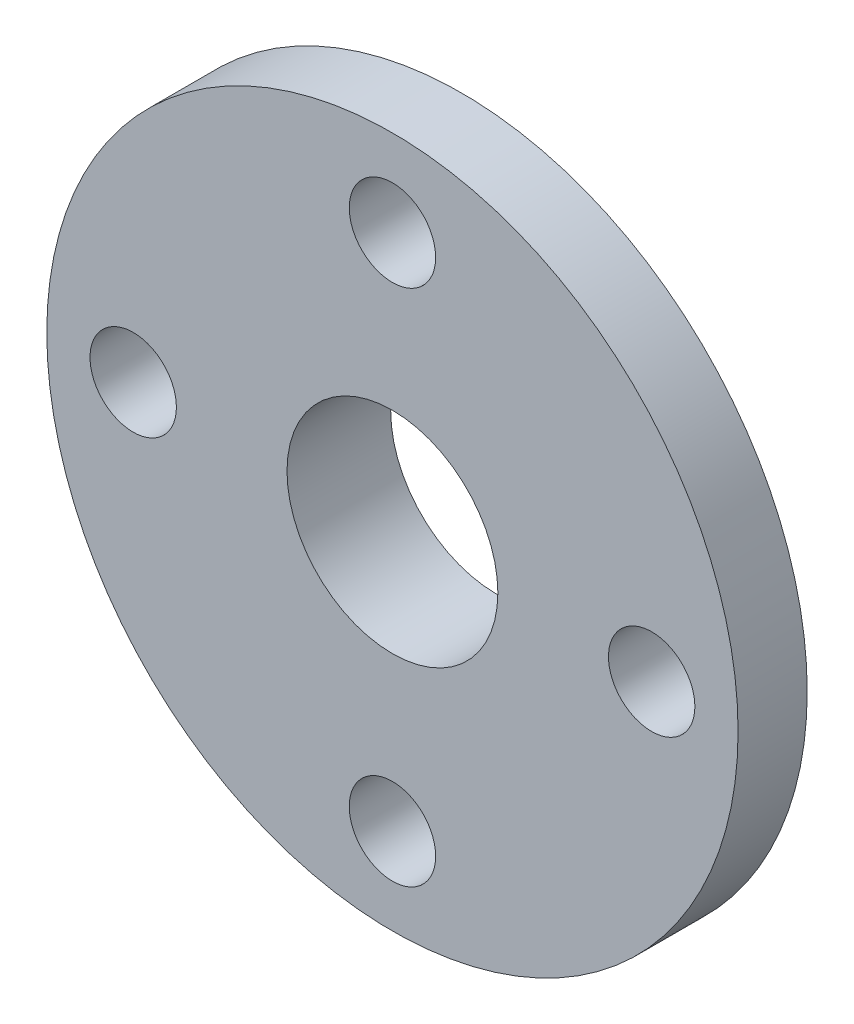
ISO-10303-21;
HEADER;
FILE_DESCRIPTION(('STEP AP214'),'2;1');
FILE_NAME('part.step','',(''),(''),'','','');
FILE_SCHEMA(('AUTOMOTIVE_DESIGN { 1 0 10303 214 1 1 1 1 }'));
ENDSEC;
DATA;
#1=APPLICATION_CONTEXT('core data for automotive mechanical design processes');
#2=APPLICATION_PROTOCOL_DEFINITION('international standard','automotive_design',2000,#1);
#3=PRODUCT_CONTEXT('',#1,'mechanical');
#4=PRODUCT('Part','Part','',(#3));
#5=PRODUCT_RELATED_PRODUCT_CATEGORY('part','',(#4));
#6=PRODUCT_DEFINITION_FORMATION('','',#4);
#7=PRODUCT_DEFINITION_CONTEXT('part definition',#1,'design');
#8=PRODUCT_DEFINITION('design','',#6,#7);
#9=PRODUCT_DEFINITION_SHAPE('','',#8);
#10=(LENGTH_UNIT() NAMED_UNIT(*) SI_UNIT(.MILLI.,.METRE.));
#11=(NAMED_UNIT(*) PLANE_ANGLE_UNIT() SI_UNIT($,.RADIAN.));
#12=(NAMED_UNIT(*) SI_UNIT($,.STERADIAN.) SOLID_ANGLE_UNIT());
#13=UNCERTAINTY_MEASURE_WITH_UNIT(LENGTH_MEASURE(1.E-05),#10,'distance_accuracy_value','');
#14=(GEOMETRIC_REPRESENTATION_CONTEXT(3) GLOBAL_UNCERTAINTY_ASSIGNED_CONTEXT((#13)) GLOBAL_UNIT_ASSIGNED_CONTEXT((#10,
#11,#12)) REPRESENTATION_CONTEXT('',''));
#15=CARTESIAN_POINT('',(0.,0.,0.));
#16=DIRECTION('',(0.,0.,1.));
#17=DIRECTION('',(1.,0.,0.));
#18=AXIS2_PLACEMENT_3D('',#15,#16,#17);
#19=CARTESIAN_POINT('',(0.,0.,2.));
#20=DIRECTION('',(0.,0.,1.));
#21=DIRECTION('',(1.,0.,0.));
#22=AXIS2_PLACEMENT_3D('',#19,#20,#21);
#23=PLANE('',#22);
#24=CARTESIAN_POINT('',(0.,0.,2.));
#25=DIRECTION('',(0.,0.,1.));
#26=DIRECTION('',(1.,0.,0.));
#27=AXIS2_PLACEMENT_3D('',#24,#25,#26);
#28=CIRCLE('',#27,3.05);
#29=CARTESIAN_POINT('',(3.05,0.,2.));
#30=VERTEX_POINT('',#29);
#31=EDGE_CURVE('E77',#30,#30,#28,.T.);
#32=ORIENTED_EDGE('',*,*,#31,.F.);
#33=EDGE_LOOP('',(#32));
#34=FACE_BOUND('',#33,.T.);
#35=CARTESIAN_POINT('',(7.5,0.,2.));
#36=DIRECTION('',(0.,0.,1.));
#37=DIRECTION('',(1.,0.,0.));
#38=AXIS2_PLACEMENT_3D('',#35,#36,#37);
#39=CIRCLE('',#38,1.25);
#40=CARTESIAN_POINT('',(8.75,0.,2.));
#41=VERTEX_POINT('',#40);
#42=EDGE_CURVE('E59',#41,#41,#39,.T.);
#43=ORIENTED_EDGE('',*,*,#42,.F.);
#44=EDGE_LOOP('',(#43));
#45=FACE_BOUND('',#44,.T.);
#46=CARTESIAN_POINT('',(-7.5,0.,2.));
#47=DIRECTION('',(0.,0.,1.));
#48=DIRECTION('',(1.,0.,0.));
#49=AXIS2_PLACEMENT_3D('',#46,#47,#48);
#50=CIRCLE('',#49,1.25);
#51=CARTESIAN_POINT('',(-6.25,0.,2.));
#52=VERTEX_POINT('',#51);
#53=EDGE_CURVE('E48',#52,#52,#50,.T.);
#54=ORIENTED_EDGE('',*,*,#53,.F.);
#55=EDGE_LOOP('',(#54));
#56=FACE_BOUND('',#55,.T.);
#57=CARTESIAN_POINT('',(0.,0.,2.));
#58=DIRECTION('',(0.,0.,1.));
#59=DIRECTION('',(1.,0.,0.));
#60=AXIS2_PLACEMENT_3D('',#57,#58,#59);
#61=CIRCLE('',#60,10.);
#62=CARTESIAN_POINT('',(10.,0.,2.));
#63=VERTEX_POINT('',#62);
#64=EDGE_CURVE('E39',#63,#63,#61,.T.);
#65=ORIENTED_EDGE('',*,*,#64,.T.);
#66=EDGE_LOOP('',(#65));
#67=FACE_BOUND('',#66,.T.);
#68=CARTESIAN_POINT('',(0.,7.5,2.));
#69=DIRECTION('',(0.,0.,1.));
#70=DIRECTION('',(1.,0.,0.));
#71=AXIS2_PLACEMENT_3D('',#68,#69,#70);
#72=CIRCLE('',#71,1.25);
#73=CARTESIAN_POINT('',(1.25,7.5,2.));
#74=VERTEX_POINT('',#73);
#75=EDGE_CURVE('E53',#74,#74,#72,.T.);
#76=ORIENTED_EDGE('',*,*,#75,.F.);
#77=EDGE_LOOP('',(#76));
#78=FACE_BOUND('',#77,.T.);
#79=CARTESIAN_POINT('',(0.,-7.5,2.));
#80=DIRECTION('',(0.,0.,1.));
#81=DIRECTION('',(1.,0.,0.));
#82=AXIS2_PLACEMENT_3D('',#79,#80,#81);
#83=CIRCLE('',#82,1.25);
#84=CARTESIAN_POINT('',(1.25,-7.5,2.));
#85=VERTEX_POINT('',#84);
#86=EDGE_CURVE('E65',#85,#85,#83,.T.);
#87=ORIENTED_EDGE('',*,*,#86,.F.);
#88=EDGE_LOOP('',(#87));
#89=FACE_BOUND('',#88,.T.);
#90=ADVANCED_FACE('F32',(#34,#45,#56,#67,#78,#89),#23,.T.);
#91=CARTESIAN_POINT('',(0.,0.,0.));
#92=DIRECTION('',(0.,0.,1.));
#93=DIRECTION('',(1.,0.,0.));
#94=AXIS2_PLACEMENT_3D('',#91,#92,#93);
#95=PLANE('',#94);
#96=CARTESIAN_POINT('',(0.,0.,0.));
#97=DIRECTION('',(0.,0.,1.));
#98=DIRECTION('',(1.,0.,0.));
#99=AXIS2_PLACEMENT_3D('',#96,#97,#98);
#100=CIRCLE('',#99,4.5);
#101=CARTESIAN_POINT('',(4.5,0.,0.));
#102=VERTEX_POINT('',#101);
#103=EDGE_CURVE('E10',#102,#102,#100,.F.);
#104=ORIENTED_EDGE('',*,*,#103,.F.);
#105=EDGE_LOOP('',(#104));
#106=FACE_BOUND('',#105,.T.);
#107=CARTESIAN_POINT('',(0.,0.,0.));
#108=DIRECTION('',(0.,0.,1.));
#109=DIRECTION('',(1.,0.,0.));
#110=AXIS2_PLACEMENT_3D('',#107,#108,#109);
#111=CIRCLE('',#110,10.);
#112=CARTESIAN_POINT('',(10.,0.,0.));
#113=VERTEX_POINT('',#112);
#114=EDGE_CURVE('E43',#113,#113,#111,.T.);
#115=ORIENTED_EDGE('',*,*,#114,.F.);
#116=EDGE_LOOP('',(#115));
#117=FACE_BOUND('',#116,.T.);
#118=CARTESIAN_POINT('',(-7.5,0.,0.));
#119=DIRECTION('',(0.,0.,1.));
#120=DIRECTION('',(1.,0.,0.));
#121=AXIS2_PLACEMENT_3D('',#118,#119,#120);
#122=CIRCLE('',#121,1.25);
#123=CARTESIAN_POINT('',(-6.25,0.,0.));
#124=VERTEX_POINT('',#123);
#125=EDGE_CURVE('E50',#124,#124,#122,.T.);
#126=ORIENTED_EDGE('',*,*,#125,.T.);
#127=EDGE_LOOP('',(#126));
#128=FACE_BOUND('',#127,.T.);
#129=CARTESIAN_POINT('',(0.,7.5,0.));
#130=DIRECTION('',(0.,0.,1.));
#131=DIRECTION('',(1.,0.,0.));
#132=AXIS2_PLACEMENT_3D('',#129,#130,#131);
#133=CIRCLE('',#132,1.25);
#134=CARTESIAN_POINT('',(1.25,7.5,0.));
#135=VERTEX_POINT('',#134);
#136=EDGE_CURVE('E56',#135,#135,#133,.T.);
#137=ORIENTED_EDGE('',*,*,#136,.T.);
#138=EDGE_LOOP('',(#137));
#139=FACE_BOUND('',#138,.T.);
#140=CARTESIAN_POINT('',(7.5,0.,0.));
#141=DIRECTION('',(0.,0.,1.));
#142=DIRECTION('',(1.,0.,0.));
#143=AXIS2_PLACEMENT_3D('',#140,#141,#142);
#144=CIRCLE('',#143,1.25);
#145=CARTESIAN_POINT('',(8.75,0.,0.));
#146=VERTEX_POINT('',#145);
#147=EDGE_CURVE('E62',#146,#146,#144,.T.);
#148=ORIENTED_EDGE('',*,*,#147,.T.);
#149=EDGE_LOOP('',(#148));
#150=FACE_BOUND('',#149,.T.);
#151=CARTESIAN_POINT('',(0.,-7.5,0.));
#152=DIRECTION('',(0.,0.,1.));
#153=DIRECTION('',(1.,0.,0.));
#154=AXIS2_PLACEMENT_3D('',#151,#152,#153);
#155=CIRCLE('',#154,1.25);
#156=CARTESIAN_POINT('',(1.25,-7.5,0.));
#157=VERTEX_POINT('',#156);
#158=EDGE_CURVE('E68',#157,#157,#155,.T.);
#159=ORIENTED_EDGE('',*,*,#158,.T.);
#160=EDGE_LOOP('',(#159));
#161=FACE_BOUND('',#160,.T.);
#162=ADVANCED_FACE('F94',(#106,#117,#128,#139,#150,#161),#95,.F.);
#163=CARTESIAN_POINT('',(0.,0.,2.));
#164=DIRECTION('',(0.,0.,-1.));
#165=DIRECTION('',(-1.,0.,0.));
#166=AXIS2_PLACEMENT_3D('',#163,#164,#165);
#167=CYLINDRICAL_SURFACE('',#166,10.);
#168=ORIENTED_EDGE('',*,*,#64,.F.);
#169=EDGE_LOOP('',(#168));
#170=FACE_BOUND('',#169,.T.);
#171=ORIENTED_EDGE('',*,*,#114,.T.);
#172=EDGE_LOOP('',(#171));
#173=FACE_BOUND('',#172,.T.);
#174=ADVANCED_FACE('F34',(#170,#173),#167,.T.);
#175=CARTESIAN_POINT('',(-7.5,0.,2.));
#176=DIRECTION('',(0.,0.,-1.));
#177=DIRECTION('',(-1.,0.,0.));
#178=AXIS2_PLACEMENT_3D('',#175,#176,#177);
#179=CYLINDRICAL_SURFACE('',#178,1.25);
#180=ORIENTED_EDGE('',*,*,#53,.T.);
#181=EDGE_LOOP('',(#180));
#182=FACE_BOUND('',#181,.T.);
#183=ORIENTED_EDGE('',*,*,#125,.F.);
#184=EDGE_LOOP('',(#183));
#185=FACE_BOUND('',#184,.T.);
#186=ADVANCED_FACE('F117',(#182,#185),#179,.F.);
#187=CARTESIAN_POINT('',(0.,7.5,2.));
#188=DIRECTION('',(0.,0.,-1.));
#189=DIRECTION('',(-1.,0.,0.));
#190=AXIS2_PLACEMENT_3D('',#187,#188,#189);
#191=CYLINDRICAL_SURFACE('',#190,1.25);
#192=ORIENTED_EDGE('',*,*,#75,.T.);
#193=EDGE_LOOP('',(#192));
#194=FACE_BOUND('',#193,.T.);
#195=ORIENTED_EDGE('',*,*,#136,.F.);
#196=EDGE_LOOP('',(#195));
#197=FACE_BOUND('',#196,.T.);
#198=ADVANCED_FACE('F123',(#194,#197),#191,.F.);
#199=CARTESIAN_POINT('',(7.5,0.,2.));
#200=DIRECTION('',(0.,0.,-1.));
#201=DIRECTION('',(-1.,0.,0.));
#202=AXIS2_PLACEMENT_3D('',#199,#200,#201);
#203=CYLINDRICAL_SURFACE('',#202,1.25);
#204=ORIENTED_EDGE('',*,*,#42,.T.);
#205=EDGE_LOOP('',(#204));
#206=FACE_BOUND('',#205,.T.);
#207=ORIENTED_EDGE('',*,*,#147,.F.);
#208=EDGE_LOOP('',(#207));
#209=FACE_BOUND('',#208,.T.);
#210=ADVANCED_FACE('F108',(#206,#209),#203,.F.);
#211=CARTESIAN_POINT('',(0.,-7.5,2.));
#212=DIRECTION('',(0.,0.,-1.));
#213=DIRECTION('',(-1.,0.,0.));
#214=AXIS2_PLACEMENT_3D('',#211,#212,#213);
#215=CYLINDRICAL_SURFACE('',#214,1.25);
#216=ORIENTED_EDGE('',*,*,#86,.T.);
#217=EDGE_LOOP('',(#216));
#218=FACE_BOUND('',#217,.T.);
#219=ORIENTED_EDGE('',*,*,#158,.F.);
#220=EDGE_LOOP('',(#219));
#221=FACE_BOUND('',#220,.T.);
#222=ADVANCED_FACE('F104',(#218,#221),#215,.F.);
#223=CARTESIAN_POINT('',(0.,0.,-1.));
#224=DIRECTION('',(0.,0.,1.));
#225=DIRECTION('',(1.,0.,0.));
#226=AXIS2_PLACEMENT_3D('',#223,#224,#225);
#227=CYLINDRICAL_SURFACE('',#226,4.5);
#228=CARTESIAN_POINT('',(0.,0.,-1.));
#229=DIRECTION('',(0.,0.,-1.));
#230=DIRECTION('',(-1.,0.,0.));
#231=AXIS2_PLACEMENT_3D('',#228,#229,#230);
#232=CIRCLE('',#231,4.5);
#233=CARTESIAN_POINT('',(-4.5,0.,-1.));
#234=VERTEX_POINT('',#233);
#235=EDGE_CURVE('E71',#234,#234,#232,.T.);
#236=ORIENTED_EDGE('',*,*,#235,.F.);
#237=EDGE_LOOP('',(#236));
#238=FACE_BOUND('',#237,.T.);
#239=ORIENTED_EDGE('',*,*,#103,.T.);
#240=EDGE_LOOP('',(#239));
#241=FACE_BOUND('',#240,.T.);
#242=ADVANCED_FACE('F107',(#238,#241),#227,.T.);
#243=CARTESIAN_POINT('',(0.,0.,-1.));
#244=DIRECTION('',(0.,0.,-1.));
#245=DIRECTION('',(-1.,0.,0.));
#246=AXIS2_PLACEMENT_3D('',#243,#244,#245);
#247=PLANE('',#246);
#248=CARTESIAN_POINT('',(0.,0.,-1.));
#249=DIRECTION('',(0.,0.,1.));
#250=DIRECTION('',(1.,0.,0.));
#251=AXIS2_PLACEMENT_3D('',#248,#249,#250);
#252=CIRCLE('',#251,3.05);
#253=CARTESIAN_POINT('',(3.05,0.,-1.));
#254=VERTEX_POINT('',#253);
#255=EDGE_CURVE('E76',#254,#254,#252,.T.);
#256=ORIENTED_EDGE('',*,*,#255,.T.);
#257=EDGE_LOOP('',(#256));
#258=FACE_BOUND('',#257,.T.);
#259=ORIENTED_EDGE('',*,*,#235,.T.);
#260=EDGE_LOOP('',(#259));
#261=FACE_BOUND('',#260,.T.);
#262=ADVANCED_FACE('F83',(#258,#261),#247,.T.);
#263=CARTESIAN_POINT('',(0.,0.,-1.));
#264=DIRECTION('',(0.,0.,1.));
#265=DIRECTION('',(1.,0.,0.));
#266=AXIS2_PLACEMENT_3D('',#263,#264,#265);
#267=CYLINDRICAL_SURFACE('',#266,3.05);
#268=ORIENTED_EDGE('',*,*,#255,.F.);
#269=EDGE_LOOP('',(#268));
#270=FACE_BOUND('',#269,.T.);
#271=ORIENTED_EDGE('',*,*,#31,.T.);
#272=EDGE_LOOP('',(#271));
#273=FACE_BOUND('',#272,.T.);
#274=ADVANCED_FACE('F86',(#270,#273),#267,.F.);
#275=CLOSED_SHELL('',(#90,#162,#174,#186,#198,#210,#222,#242,#262,#274));
#276=MANIFOLD_SOLID_BREP('B2',#275);
#277=ADVANCED_BREP_SHAPE_REPRESENTATION('',(#18,#276),#14);
#278=SHAPE_DEFINITION_REPRESENTATION(#9,#277);
ENDSEC;
END-ISO-10303-21;
